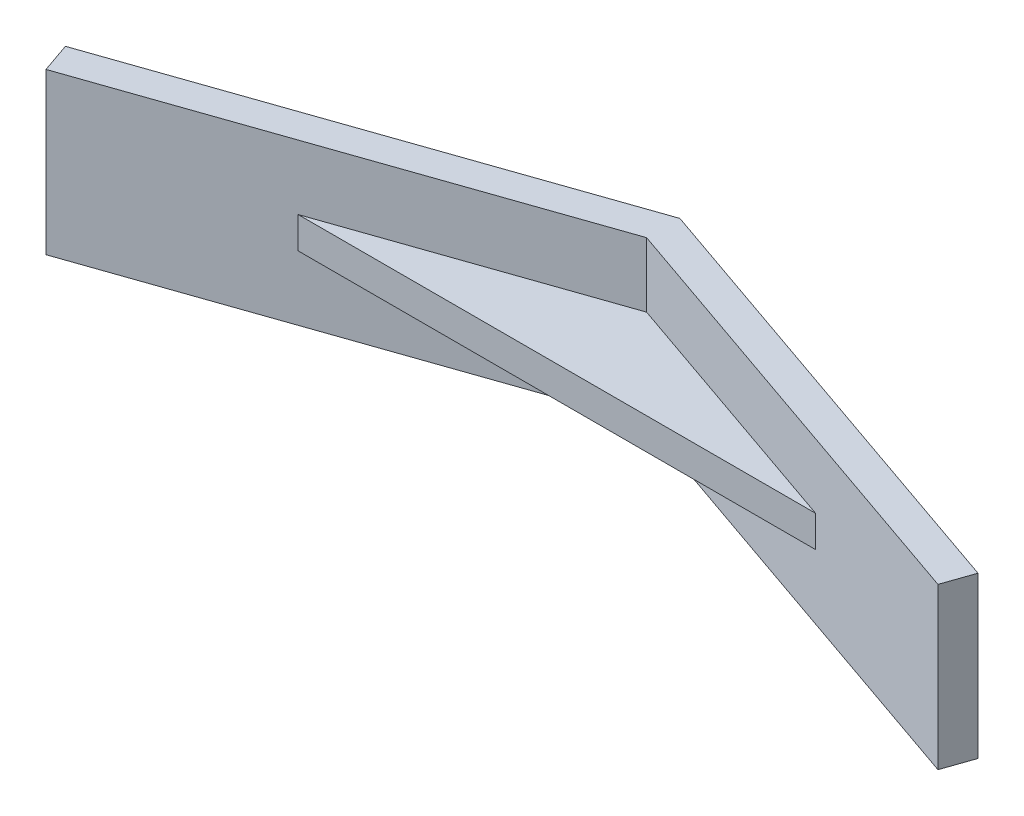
from build123d import *

# Parameters (mm, degrees)
SALIENTE_EXTRUIR1_DEPTH = 25.5
NERVIO1_REACH           = 160.875
CROQUIS3_WALL_W         = 484.214905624
CROQUIS3_WALL_H         = 10


with BuildPart() as part:
    # Croquis2 → Saliente-Extruir1 (new, symmetric)
    with BuildSketch(Plane(origin=(0, 0, 0), x_dir=(1, 0, 0), z_dir=(0, 1, 0))):
        Polygon((-141.725429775, 0), (0, 49.131482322), (141.725429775, 0), (145.00086193, 9.448361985), (0, 59.715327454), (-145.00086193, 9.448361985), align=None)
    extrude(amount=SALIENTE_EXTRUIR1_DEPTH, both=True)

    # Croquis3 wall → Nervio1 (add, up to next)
    with BuildSketch(Plane(origin=(0, 0, -20.624400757), x_dir=(1, 0, 0), z_dir=(0, 0, -1)), mode=Mode.PRIVATE) as nervio1_sk1:
        Rectangle(CROQUIS3_WALL_W, CROQUIS3_WALL_H)
    nervio1_tool1 = extrude(nervio1_sk1.sketch, amount=NERVIO1_REACH, mode=Mode.PRIVATE) - part.part
    add(nervio1_tool1.solids().sort_by_distance((0, 0, -20.624400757))[0])


solid = part.part
